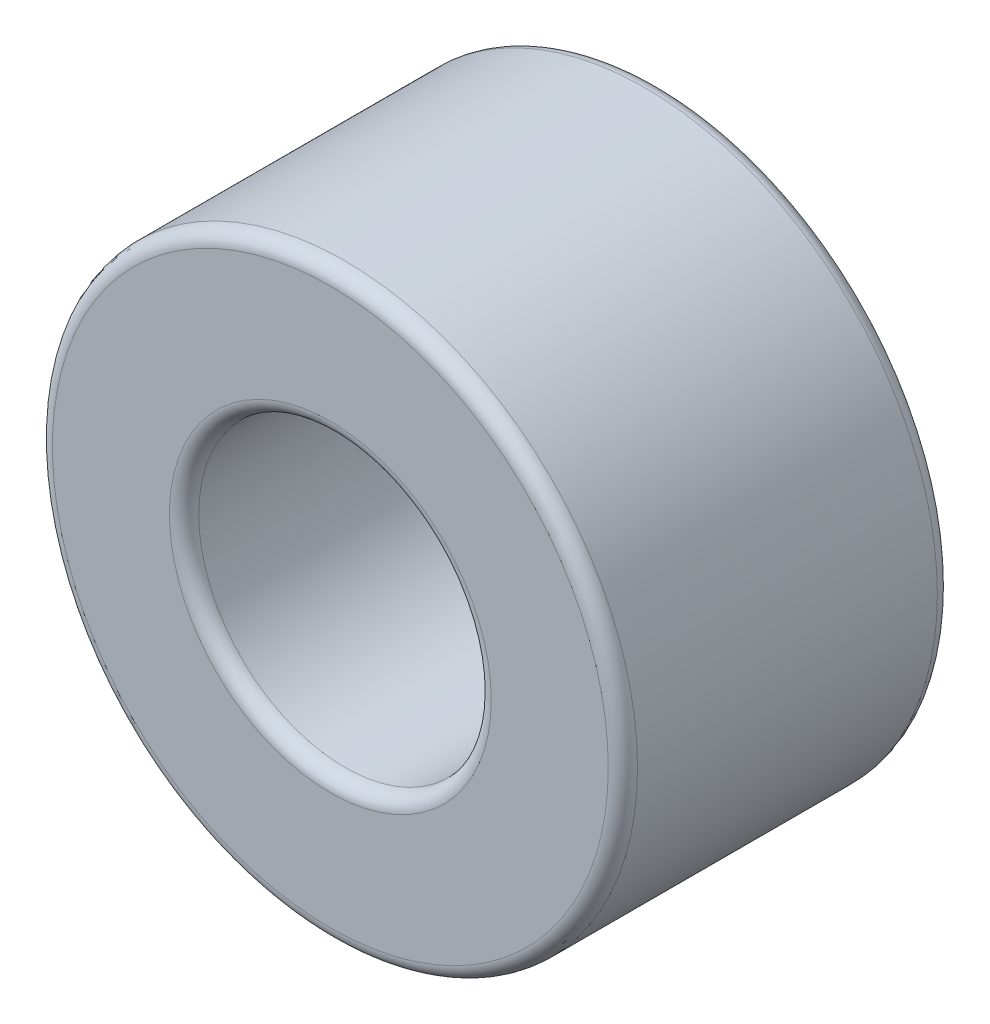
ISO-10303-21;
HEADER;
FILE_DESCRIPTION(('STEP AP214'),'2;1');
FILE_NAME('part.step','',(''),(''),'','','');
FILE_SCHEMA(('AUTOMOTIVE_DESIGN { 1 0 10303 214 1 1 1 1 }'));
ENDSEC;
DATA;
#1=APPLICATION_CONTEXT('core data for automotive mechanical design processes');
#2=APPLICATION_PROTOCOL_DEFINITION('international standard','automotive_design',2000,#1);
#3=PRODUCT_CONTEXT('',#1,'mechanical');
#4=PRODUCT('Part','Part','',(#3));
#5=PRODUCT_RELATED_PRODUCT_CATEGORY('part','',(#4));
#6=PRODUCT_DEFINITION_FORMATION('','',#4);
#7=PRODUCT_DEFINITION_CONTEXT('part definition',#1,'design');
#8=PRODUCT_DEFINITION('design','',#6,#7);
#9=PRODUCT_DEFINITION_SHAPE('','',#8);
#10=(LENGTH_UNIT() NAMED_UNIT(*) SI_UNIT(.MILLI.,.METRE.));
#11=(NAMED_UNIT(*) PLANE_ANGLE_UNIT() SI_UNIT($,.RADIAN.));
#12=(NAMED_UNIT(*) SI_UNIT($,.STERADIAN.) SOLID_ANGLE_UNIT());
#13=UNCERTAINTY_MEASURE_WITH_UNIT(LENGTH_MEASURE(1.E-05),#10,'distance_accuracy_value','');
#14=(GEOMETRIC_REPRESENTATION_CONTEXT(3) GLOBAL_UNCERTAINTY_ASSIGNED_CONTEXT((#13)) GLOBAL_UNIT_ASSIGNED_CONTEXT((#10,
#11,#12)) REPRESENTATION_CONTEXT('',''));
#15=CARTESIAN_POINT('',(0.,0.,0.));
#16=DIRECTION('',(0.,0.,1.));
#17=DIRECTION('',(1.,0.,0.));
#18=AXIS2_PLACEMENT_3D('',#15,#16,#17);
#19=CARTESIAN_POINT('',(0.,0.,4.5));
#20=DIRECTION('',(0.,0.,1.));
#21=DIRECTION('',(1.,0.,0.));
#22=AXIS2_PLACEMENT_3D('',#19,#20,#21);
#23=PLANE('',#22);
#24=CARTESIAN_POINT('',(0.,0.,4.5));
#25=DIRECTION('',(0.,0.,1.));
#26=DIRECTION('',(1.,0.,0.));
#27=AXIS2_PLACEMENT_3D('',#24,#25,#26);
#28=CIRCLE('',#27,3.8);
#29=CARTESIAN_POINT('',(3.8,0.,4.5));
#30=VERTEX_POINT('',#29);
#31=EDGE_CURVE('E42',#30,#30,#28,.T.);
#32=ORIENTED_EDGE('',*,*,#31,.T.);
#33=EDGE_LOOP('',(#32));
#34=FACE_BOUND('',#33,.T.);
#35=CARTESIAN_POINT('',(0.,0.,4.5));
#36=DIRECTION('',(0.,0.,1.));
#37=DIRECTION('',(1.,0.,0.));
#38=AXIS2_PLACEMENT_3D('',#35,#36,#37);
#39=CIRCLE('',#38,2.2);
#40=CARTESIAN_POINT('',(2.2,0.,4.5));
#41=VERTEX_POINT('',#40);
#42=EDGE_CURVE('E46',#41,#41,#39,.F.);
#43=ORIENTED_EDGE('',*,*,#42,.T.);
#44=EDGE_LOOP('',(#43));
#45=FACE_BOUND('',#44,.T.);
#46=ADVANCED_FACE('F31',(#34,#45),#23,.T.);
#47=CARTESIAN_POINT('',(0.,0.,0.));
#48=DIRECTION('',(0.,0.,1.));
#49=DIRECTION('',(1.,0.,0.));
#50=AXIS2_PLACEMENT_3D('',#47,#48,#49);
#51=PLANE('',#50);
#52=CARTESIAN_POINT('',(0.,0.,0.));
#53=DIRECTION('',(0.,0.,1.));
#54=DIRECTION('',(1.,0.,0.));
#55=AXIS2_PLACEMENT_3D('',#52,#53,#54);
#56=CIRCLE('',#55,3.8);
#57=CARTESIAN_POINT('',(3.8,0.,0.));
#58=VERTEX_POINT('',#57);
#59=EDGE_CURVE('E52',#58,#58,#56,.F.);
#60=ORIENTED_EDGE('',*,*,#59,.T.);
#61=EDGE_LOOP('',(#60));
#62=FACE_BOUND('',#61,.T.);
#63=CARTESIAN_POINT('',(0.,0.,0.));
#64=DIRECTION('',(0.,0.,1.));
#65=DIRECTION('',(1.,0.,0.));
#66=AXIS2_PLACEMENT_3D('',#63,#64,#65);
#67=CIRCLE('',#66,2.2);
#68=CARTESIAN_POINT('',(2.2,0.,0.));
#69=VERTEX_POINT('',#68);
#70=EDGE_CURVE('E55',#69,#69,#67,.T.);
#71=ORIENTED_EDGE('',*,*,#70,.T.);
#72=EDGE_LOOP('',(#71));
#73=FACE_BOUND('',#72,.T.);
#74=ADVANCED_FACE('F76',(#62,#73),#51,.F.);
#75=CARTESIAN_POINT('',(0.,0.,4.5));
#76=DIRECTION('',(0.,0.,-1.));
#77=DIRECTION('',(-1.,0.,0.));
#78=AXIS2_PLACEMENT_3D('',#75,#76,#77);
#79=CYLINDRICAL_SURFACE('',#78,4.);
#80=CARTESIAN_POINT('',(0.,0.,0.2));
#81=DIRECTION('',(0.,0.,1.));
#82=DIRECTION('',(1.,0.,0.));
#83=AXIS2_PLACEMENT_3D('',#80,#81,#82);
#84=CIRCLE('',#83,4.);
#85=CARTESIAN_POINT('',(4.,0.,0.2));
#86=VERTEX_POINT('',#85);
#87=EDGE_CURVE('E58',#86,#86,#84,.T.);
#88=ORIENTED_EDGE('',*,*,#87,.T.);
#89=EDGE_LOOP('',(#88));
#90=FACE_BOUND('',#89,.T.);
#91=CARTESIAN_POINT('',(0.,0.,4.3));
#92=DIRECTION('',(0.,0.,1.));
#93=DIRECTION('',(1.,0.,0.));
#94=AXIS2_PLACEMENT_3D('',#91,#92,#93);
#95=CIRCLE('',#94,4.);
#96=CARTESIAN_POINT('',(4.,0.,4.3));
#97=VERTEX_POINT('',#96);
#98=EDGE_CURVE('E61',#97,#97,#95,.F.);
#99=ORIENTED_EDGE('',*,*,#98,.T.);
#100=EDGE_LOOP('',(#99));
#101=FACE_BOUND('',#100,.T.);
#102=ADVANCED_FACE('F33',(#90,#101),#79,.T.);
#103=CARTESIAN_POINT('',(0.,0.,4.5));
#104=DIRECTION('',(0.,0.,-1.));
#105=DIRECTION('',(-1.,0.,0.));
#106=AXIS2_PLACEMENT_3D('',#103,#104,#105);
#107=CYLINDRICAL_SURFACE('',#106,2.);
#108=CARTESIAN_POINT('',(0.,0.,0.2));
#109=DIRECTION('',(0.,0.,1.));
#110=DIRECTION('',(1.,0.,0.));
#111=AXIS2_PLACEMENT_3D('',#108,#109,#110);
#112=CIRCLE('',#111,2.);
#113=CARTESIAN_POINT('',(2.,0.,0.2));
#114=VERTEX_POINT('',#113);
#115=EDGE_CURVE('E10',#114,#114,#112,.F.);
#116=ORIENTED_EDGE('',*,*,#115,.T.);
#117=EDGE_LOOP('',(#116));
#118=FACE_BOUND('',#117,.T.);
#119=CARTESIAN_POINT('',(0.,0.,4.3));
#120=DIRECTION('',(0.,0.,1.));
#121=DIRECTION('',(1.,0.,0.));
#122=AXIS2_PLACEMENT_3D('',#119,#120,#121);
#123=CIRCLE('',#122,2.);
#124=CARTESIAN_POINT('',(2.,0.,4.3));
#125=VERTEX_POINT('',#124);
#126=EDGE_CURVE('E38',#125,#125,#123,.T.);
#127=ORIENTED_EDGE('',*,*,#126,.T.);
#128=EDGE_LOOP('',(#127));
#129=FACE_BOUND('',#128,.T.);
#130=ADVANCED_FACE('F91',(#118,#129),#107,.F.);
#131=CARTESIAN_POINT('',(0.,0.,0.2));
#132=DIRECTION('',(0.,0.,1.));
#133=DIRECTION('',(1.,0.,0.));
#134=AXIS2_PLACEMENT_3D('',#131,#132,#133);
#135=TOROIDAL_SURFACE('',#134,3.8,0.2);
#136=ORIENTED_EDGE('',*,*,#59,.F.);
#137=EDGE_LOOP('',(#136));
#138=FACE_BOUND('',#137,.T.);
#139=ORIENTED_EDGE('',*,*,#87,.F.);
#140=EDGE_LOOP('',(#139));
#141=FACE_BOUND('',#140,.T.);
#142=ADVANCED_FACE('F70',(#138,#141),#135,.T.);
#143=CARTESIAN_POINT('',(0.,0.,4.3));
#144=DIRECTION('',(0.,0.,1.));
#145=DIRECTION('',(1.,0.,0.));
#146=AXIS2_PLACEMENT_3D('',#143,#144,#145);
#147=TOROIDAL_SURFACE('',#146,3.8,0.2);
#148=ORIENTED_EDGE('',*,*,#98,.F.);
#149=EDGE_LOOP('',(#148));
#150=FACE_BOUND('',#149,.T.);
#151=ORIENTED_EDGE('',*,*,#31,.F.);
#152=EDGE_LOOP('',(#151));
#153=FACE_BOUND('',#152,.T.);
#154=ADVANCED_FACE('F66',(#150,#153),#147,.T.);
#155=CARTESIAN_POINT('',(0.,0.,0.2));
#156=DIRECTION('',(0.,0.,1.));
#157=DIRECTION('',(1.,0.,0.));
#158=AXIS2_PLACEMENT_3D('',#155,#156,#157);
#159=TOROIDAL_SURFACE('',#158,2.2,0.2);
#160=ORIENTED_EDGE('',*,*,#115,.F.);
#161=EDGE_LOOP('',(#160));
#162=FACE_BOUND('',#161,.T.);
#163=ORIENTED_EDGE('',*,*,#70,.F.);
#164=EDGE_LOOP('',(#163));
#165=FACE_BOUND('',#164,.T.);
#166=ADVANCED_FACE('F69',(#162,#165),#159,.T.);
#167=CARTESIAN_POINT('',(0.,0.,4.3));
#168=DIRECTION('',(0.,0.,1.));
#169=DIRECTION('',(1.,0.,0.));
#170=AXIS2_PLACEMENT_3D('',#167,#168,#169);
#171=TOROIDAL_SURFACE('',#170,2.2,0.2);
#172=ORIENTED_EDGE('',*,*,#42,.F.);
#173=EDGE_LOOP('',(#172));
#174=FACE_BOUND('',#173,.T.);
#175=ORIENTED_EDGE('',*,*,#126,.F.);
#176=EDGE_LOOP('',(#175));
#177=FACE_BOUND('',#176,.T.);
#178=ADVANCED_FACE('F79',(#174,#177),#171,.T.);
#179=CLOSED_SHELL('',(#46,#74,#102,#130,#142,#154,#166,#178));
#180=MANIFOLD_SOLID_BREP('B2',#179);
#181=ADVANCED_BREP_SHAPE_REPRESENTATION('',(#18,#180),#14);
#182=SHAPE_DEFINITION_REPRESENTATION(#9,#181);
ENDSEC;
END-ISO-10303-21;
